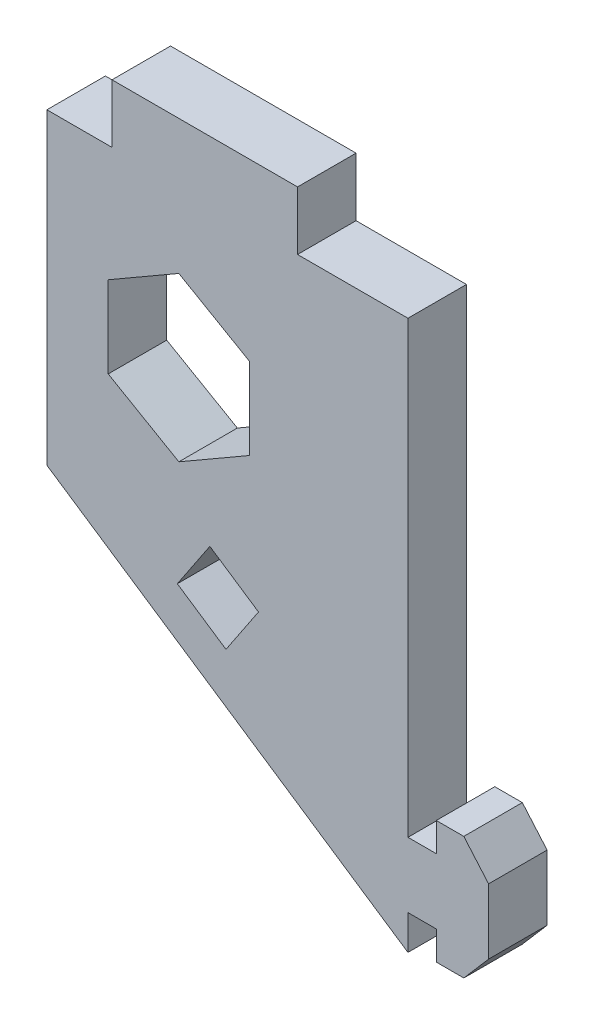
ISO-10303-21;
HEADER;
FILE_DESCRIPTION(('STEP AP214'),'2;1');
FILE_NAME('part.step','',(''),(''),'','','');
FILE_SCHEMA(('AUTOMOTIVE_DESIGN { 1 0 10303 214 1 1 1 1 }'));
ENDSEC;
DATA;
#1=APPLICATION_CONTEXT('core data for automotive mechanical design processes');
#2=APPLICATION_PROTOCOL_DEFINITION('international standard','automotive_design',2000,#1);
#3=PRODUCT_CONTEXT('',#1,'mechanical');
#4=PRODUCT('Part','Part','',(#3));
#5=PRODUCT_RELATED_PRODUCT_CATEGORY('part','',(#4));
#6=PRODUCT_DEFINITION_FORMATION('','',#4);
#7=PRODUCT_DEFINITION_CONTEXT('part definition',#1,'design');
#8=PRODUCT_DEFINITION('design','',#6,#7);
#9=PRODUCT_DEFINITION_SHAPE('','',#8);
#10=(LENGTH_UNIT() NAMED_UNIT(*) SI_UNIT(.MILLI.,.METRE.));
#11=(NAMED_UNIT(*) PLANE_ANGLE_UNIT() SI_UNIT($,.RADIAN.));
#12=(NAMED_UNIT(*) SI_UNIT($,.STERADIAN.) SOLID_ANGLE_UNIT());
#13=UNCERTAINTY_MEASURE_WITH_UNIT(LENGTH_MEASURE(1.E-05),#10,'distance_accuracy_value','');
#14=(GEOMETRIC_REPRESENTATION_CONTEXT(3) GLOBAL_UNCERTAINTY_ASSIGNED_CONTEXT((#13)) GLOBAL_UNIT_ASSIGNED_CONTEXT((#10,
#11,#12)) REPRESENTATION_CONTEXT('',''));
#15=CARTESIAN_POINT('',(0.,0.,0.));
#16=DIRECTION('',(0.,0.,1.));
#17=DIRECTION('',(1.,0.,0.));
#18=AXIS2_PLACEMENT_3D('',#15,#16,#17);
#19=CARTESIAN_POINT('',(-817.146115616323,0.,5.3848));
#20=DIRECTION('',(1.,0.,0.));
#21=DIRECTION('',(0.,0.,-1.));
#22=AXIS2_PLACEMENT_3D('',#19,#20,#21);
#23=PLANE('',#22);
#24=DIRECTION('',(0.,-1.,0.));
#25=VECTOR('',#24,1.);
#26=CARTESIAN_POINT('',(-817.146115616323,0.,0.));
#27=LINE('',#26,#25);
#28=CARTESIAN_POINT('',(-817.146115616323,356.815132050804,0.));
#29=VERTEX_POINT('',#28);
#30=CARTESIAN_POINT('',(-817.146115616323,349.309578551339,0.));
#31=VERTEX_POINT('',#30);
#32=EDGE_CURVE('E377',#29,#31,#27,.T.);
#33=ORIENTED_EDGE('',*,*,#32,.F.);
#34=DIRECTION('',(0.,0.,-1.));
#35=VECTOR('',#34,1.);
#36=CARTESIAN_POINT('',(-817.146115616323,356.815132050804,5.3848));
#37=LINE('',#36,#35);
#38=CARTESIAN_POINT('',(-817.146115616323,356.815132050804,5.3848));
#39=VERTEX_POINT('',#38);
#40=EDGE_CURVE('E12',#39,#29,#37,.T.);
#41=ORIENTED_EDGE('',*,*,#40,.F.);
#42=DIRECTION('',(0.,-1.,0.));
#43=VECTOR('',#42,1.);
#44=CARTESIAN_POINT('',(-817.146115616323,0.,5.3848));
#45=LINE('',#44,#43);
#46=CARTESIAN_POINT('',(-817.146115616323,349.309578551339,5.3848));
#47=VERTEX_POINT('',#46);
#48=EDGE_CURVE('E325',#39,#47,#45,.T.);
#49=ORIENTED_EDGE('',*,*,#48,.T.);
#50=DIRECTION('',(0.,0.,-1.));
#51=VECTOR('',#50,1.);
#52=CARTESIAN_POINT('',(-817.146115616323,349.309578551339,5.3848));
#53=LINE('',#52,#51);
#54=EDGE_CURVE('E394',#47,#31,#53,.T.);
#55=ORIENTED_EDGE('',*,*,#54,.T.);
#56=EDGE_LOOP('',(#33,#41,#49,#55));
#57=FACE_BOUND('',#56,.T.);
#58=ADVANCED_FACE('F38',(#57),#23,.T.);
#59=CARTESIAN_POINT('',(-358.792013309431,621.445996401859,5.3848));
#60=DIRECTION('',(0.500000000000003,-0.866025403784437,0.));
#61=DIRECTION('',(0.866025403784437,0.500000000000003,0.));
#62=AXIS2_PLACEMENT_3D('',#59,#60,#61);
#63=PLANE('',#62);
#64=DIRECTION('',(-0.866025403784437,-0.500000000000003,0.));
#65=VECTOR('',#64,1.);
#66=CARTESIAN_POINT('',(-358.792013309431,621.445996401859,0.));
#67=LINE('',#66,#65);
#68=CARTESIAN_POINT('',(-810.646115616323,360.567908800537,0.));
#69=VERTEX_POINT('',#68);
#70=EDGE_CURVE('E380',#69,#29,#67,.T.);
#71=ORIENTED_EDGE('',*,*,#70,.F.);
#72=DIRECTION('',(0.,0.,-1.));
#73=VECTOR('',#72,1.);
#74=CARTESIAN_POINT('',(-810.646115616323,360.567908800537,5.3848));
#75=LINE('',#74,#73);
#76=CARTESIAN_POINT('',(-810.646115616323,360.567908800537,5.3848));
#77=VERTEX_POINT('',#76);
#78=EDGE_CURVE('E47',#77,#69,#75,.T.);
#79=ORIENTED_EDGE('',*,*,#78,.F.);
#80=DIRECTION('',(-0.866025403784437,-0.500000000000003,0.));
#81=VECTOR('',#80,1.);
#82=CARTESIAN_POINT('',(-358.792013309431,621.445996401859,5.3848));
#83=LINE('',#82,#81);
#84=EDGE_CURVE('E328',#77,#39,#83,.T.);
#85=ORIENTED_EDGE('',*,*,#84,.T.);
#86=ORIENTED_EDGE('',*,*,#40,.T.);
#87=EDGE_LOOP('',(#71,#79,#85,#86));
#88=FACE_BOUND('',#87,.T.);
#89=ADVANCED_FACE('F525',(#88),#63,.T.);
#90=CARTESIAN_POINT('',(-46.5310444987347,-80.5941332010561,5.3848));
#91=DIRECTION('',(0.500000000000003,0.866025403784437,0.));
#92=DIRECTION('',(-0.866025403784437,0.500000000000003,0.));
#93=AXIS2_PLACEMENT_3D('',#90,#91,#92);
#94=PLANE('',#93);
#95=DIRECTION('',(0.866025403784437,-0.500000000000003,0.));
#96=VECTOR('',#95,1.);
#97=CARTESIAN_POINT('',(-46.5310444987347,-80.5941332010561,0.));
#98=LINE('',#97,#96);
#99=CARTESIAN_POINT('',(-804.146115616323,356.815132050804,0.));
#100=VERTEX_POINT('',#99);
#101=EDGE_CURVE('E383',#69,#100,#98,.T.);
#102=ORIENTED_EDGE('',*,*,#101,.T.);
#103=DIRECTION('',(0.,0.,-1.));
#104=VECTOR('',#103,1.);
#105=CARTESIAN_POINT('',(-804.146115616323,356.815132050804,5.3848));
#106=LINE('',#105,#104);
#107=CARTESIAN_POINT('',(-804.146115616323,356.815132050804,5.3848));
#108=VERTEX_POINT('',#107);
#109=EDGE_CURVE('E402',#108,#100,#106,.T.);
#110=ORIENTED_EDGE('',*,*,#109,.F.);
#111=DIRECTION('',(0.866025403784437,-0.500000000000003,0.));
#112=VECTOR('',#111,1.);
#113=CARTESIAN_POINT('',(-46.5310444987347,-80.5941332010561,5.3848));
#114=LINE('',#113,#112);
#115=EDGE_CURVE('E331',#77,#108,#114,.T.);
#116=ORIENTED_EDGE('',*,*,#115,.F.);
#117=ORIENTED_EDGE('',*,*,#78,.T.);
#118=EDGE_LOOP('',(#102,#110,#116,#117));
#119=FACE_BOUND('',#118,.T.);
#120=ADVANCED_FACE('F531',(#119),#94,.F.);
#121=CARTESIAN_POINT('',(-804.146115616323,0.,5.3848));
#122=DIRECTION('',(1.,0.,0.));
#123=DIRECTION('',(0.,0.,-1.));
#124=AXIS2_PLACEMENT_3D('',#121,#122,#123);
#125=PLANE('',#124);
#126=DIRECTION('',(0.,-1.,0.));
#127=VECTOR('',#126,1.);
#128=CARTESIAN_POINT('',(-804.146115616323,0.,0.));
#129=LINE('',#128,#127);
#130=CARTESIAN_POINT('',(-804.146115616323,349.309578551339,0.));
#131=VERTEX_POINT('',#130);
#132=EDGE_CURVE('E386',#100,#131,#129,.T.);
#133=ORIENTED_EDGE('',*,*,#132,.T.);
#134=DIRECTION('',(0.,0.,-1.));
#135=VECTOR('',#134,1.);
#136=CARTESIAN_POINT('',(-804.146115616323,349.309578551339,5.3848));
#137=LINE('',#136,#135);
#138=CARTESIAN_POINT('',(-804.146115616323,349.309578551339,5.3848));
#139=VERTEX_POINT('',#138);
#140=EDGE_CURVE('E399',#139,#131,#137,.T.);
#141=ORIENTED_EDGE('',*,*,#140,.F.);
#142=DIRECTION('',(0.,-1.,0.));
#143=VECTOR('',#142,1.);
#144=CARTESIAN_POINT('',(-804.146115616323,0.,5.3848));
#145=LINE('',#144,#143);
#146=EDGE_CURVE('E334',#108,#139,#145,.T.);
#147=ORIENTED_EDGE('',*,*,#146,.F.);
#148=ORIENTED_EDGE('',*,*,#109,.T.);
#149=EDGE_LOOP('',(#133,#141,#147,#148));
#150=FACE_BOUND('',#149,.T.);
#151=ADVANCED_FACE('F747',(#150),#125,.F.);
#152=CARTESIAN_POINT('',(-352.292013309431,610.187666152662,5.3848));
#153=DIRECTION('',(0.500000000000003,-0.866025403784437,0.));
#154=DIRECTION('',(0.866025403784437,0.500000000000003,0.));
#155=AXIS2_PLACEMENT_3D('',#152,#153,#154);
#156=PLANE('',#155);
#157=DIRECTION('',(-0.866025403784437,-0.500000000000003,0.));
#158=VECTOR('',#157,1.);
#159=CARTESIAN_POINT('',(-352.292013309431,610.187666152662,0.));
#160=LINE('',#159,#158);
#161=CARTESIAN_POINT('',(-810.646115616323,345.556801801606,0.));
#162=VERTEX_POINT('',#161);
#163=EDGE_CURVE('E389',#131,#162,#160,.T.);
#164=ORIENTED_EDGE('',*,*,#163,.T.);
#165=DIRECTION('',(0.,0.,-1.));
#166=VECTOR('',#165,1.);
#167=CARTESIAN_POINT('',(-810.646115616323,345.556801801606,5.3848));
#168=LINE('',#167,#166);
#169=CARTESIAN_POINT('',(-810.646115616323,345.556801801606,5.3848));
#170=VERTEX_POINT('',#169);
#171=EDGE_CURVE('E396',#170,#162,#168,.T.);
#172=ORIENTED_EDGE('',*,*,#171,.F.);
#173=DIRECTION('',(-0.866025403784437,-0.500000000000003,0.));
#174=VECTOR('',#173,1.);
#175=CARTESIAN_POINT('',(-352.292013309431,610.187666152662,5.3848));
#176=LINE('',#175,#174);
#177=EDGE_CURVE('E337',#139,#170,#176,.T.);
#178=ORIENTED_EDGE('',*,*,#177,.F.);
#179=ORIENTED_EDGE('',*,*,#140,.T.);
#180=EDGE_LOOP('',(#164,#172,#178,#179));
#181=FACE_BOUND('',#180,.T.);
#182=ADVANCED_FACE('F740',(#181),#156,.F.);
#183=CARTESIAN_POINT('',(-789.564115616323,0.,5.3848));
#184=DIRECTION('',(1.,0.,0.));
#185=DIRECTION('',(0.,0.,-1.));
#186=AXIS2_PLACEMENT_3D('',#183,#184,#185);
#187=PLANE('',#186);
#188=DIRECTION('',(0.,-1.,0.));
#189=VECTOR('',#188,1.);
#190=CARTESIAN_POINT('',(-789.564115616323,0.,0.));
#191=LINE('',#190,#189);
#192=CARTESIAN_POINT('',(-789.564115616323,320.175836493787,0.));
#193=VERTEX_POINT('',#192);
#194=CARTESIAN_POINT('',(-789.564115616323,317.000836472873,0.));
#195=VERTEX_POINT('',#194);
#196=EDGE_CURVE('E290',#193,#195,#191,.T.);
#197=ORIENTED_EDGE('',*,*,#196,.F.);
#198=DIRECTION('',(0.,0.,-1.));
#199=VECTOR('',#198,1.);
#200=CARTESIAN_POINT('',(-789.564115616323,320.175836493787,5.3848));
#201=LINE('',#200,#199);
#202=CARTESIAN_POINT('',(-789.564115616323,320.175836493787,5.3848));
#203=VERTEX_POINT('',#202);
#204=EDGE_CURVE('E42',#203,#193,#201,.T.);
#205=ORIENTED_EDGE('',*,*,#204,.F.);
#206=DIRECTION('',(0.,-1.,0.));
#207=VECTOR('',#206,1.);
#208=CARTESIAN_POINT('',(-789.564115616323,0.,5.3848));
#209=LINE('',#208,#207);
#210=CARTESIAN_POINT('',(-789.564115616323,317.000836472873,5.3848));
#211=VERTEX_POINT('',#210);
#212=EDGE_CURVE('E291',#203,#211,#209,.T.);
#213=ORIENTED_EDGE('',*,*,#212,.T.);
#214=DIRECTION('',(0.,0.,-1.));
#215=VECTOR('',#214,1.);
#216=CARTESIAN_POINT('',(-789.564115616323,317.000836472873,5.3848));
#217=LINE('',#216,#215);
#218=EDGE_CURVE('E342',#211,#195,#217,.T.);
#219=ORIENTED_EDGE('',*,*,#218,.T.);
#220=EDGE_LOOP('',(#197,#205,#213,#219));
#221=FACE_BOUND('',#220,.T.);
#222=ADVANCED_FACE('F40',(#221),#187,.T.);
#223=CARTESIAN_POINT('',(0.,320.175836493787,5.3848));
#224=DIRECTION('',(0.,1.,0.));
#225=DIRECTION('',(0.,0.,1.));
#226=AXIS2_PLACEMENT_3D('',#223,#224,#225);
#227=PLANE('',#226);
#228=DIRECTION('',(1.,0.,0.));
#229=VECTOR('',#228,1.);
#230=CARTESIAN_POINT('',(0.,320.175836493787,0.));
#231=LINE('',#230,#229);
#232=CARTESIAN_POINT('',(-786.957440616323,320.175836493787,0.));
#233=VERTEX_POINT('',#232);
#234=EDGE_CURVE('E345',#193,#233,#231,.T.);
#235=ORIENTED_EDGE('',*,*,#234,.T.);
#236=DIRECTION('',(0.,0.,-1.));
#237=VECTOR('',#236,1.);
#238=CARTESIAN_POINT('',(-786.957440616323,320.175836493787,5.3848));
#239=LINE('',#238,#237);
#240=CARTESIAN_POINT('',(-786.957440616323,320.175836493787,5.3848));
#241=VERTEX_POINT('',#240);
#242=EDGE_CURVE('E429',#241,#233,#239,.T.);
#243=ORIENTED_EDGE('',*,*,#242,.F.);
#244=DIRECTION('',(1.,0.,0.));
#245=VECTOR('',#244,1.);
#246=CARTESIAN_POINT('',(0.,320.175836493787,5.3848));
#247=LINE('',#246,#245);
#248=EDGE_CURVE('E294',#203,#241,#247,.T.);
#249=ORIENTED_EDGE('',*,*,#248,.F.);
#250=ORIENTED_EDGE('',*,*,#204,.T.);
#251=EDGE_LOOP('',(#235,#243,#249,#250));
#252=FACE_BOUND('',#251,.T.);
#253=ADVANCED_FACE('F438',(#252),#227,.F.);
#254=CARTESIAN_POINT('',(-786.957440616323,0.,5.3848));
#255=DIRECTION('',(1.,0.,0.));
#256=DIRECTION('',(0.,0.,-1.));
#257=AXIS2_PLACEMENT_3D('',#254,#255,#256);
#258=PLANE('',#257);
#259=DIRECTION('',(0.,-1.,0.));
#260=VECTOR('',#259,1.);
#261=CARTESIAN_POINT('',(-786.957440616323,0.,0.));
#262=LINE('',#261,#260);
#263=CARTESIAN_POINT('',(-786.957440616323,317.531556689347,0.));
#264=VERTEX_POINT('',#263);
#265=EDGE_CURVE('E347',#233,#264,#262,.T.);
#266=ORIENTED_EDGE('',*,*,#265,.T.);
#267=DIRECTION('',(0.,0.,-1.));
#268=VECTOR('',#267,1.);
#269=CARTESIAN_POINT('',(-786.957440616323,317.531556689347,5.3848));
#270=LINE('',#269,#268);
#271=CARTESIAN_POINT('',(-786.957440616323,317.531556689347,5.3848));
#272=VERTEX_POINT('',#271);
#273=EDGE_CURVE('E427',#272,#264,#270,.T.);
#274=ORIENTED_EDGE('',*,*,#273,.F.);
#275=DIRECTION('',(0.,-1.,0.));
#276=VECTOR('',#275,1.);
#277=CARTESIAN_POINT('',(-786.957440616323,0.,5.3848));
#278=LINE('',#277,#276);
#279=EDGE_CURVE('E297',#241,#272,#278,.T.);
#280=ORIENTED_EDGE('',*,*,#279,.F.);
#281=ORIENTED_EDGE('',*,*,#242,.T.);
#282=EDGE_LOOP('',(#266,#274,#280,#281));
#283=FACE_BOUND('',#282,.T.);
#284=ADVANCED_FACE('F516',(#283),#258,.F.);
#285=CARTESIAN_POINT('',(0.,317.531556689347,5.3848));
#286=DIRECTION('',(0.,1.,0.));
#287=DIRECTION('',(0.,0.,1.));
#288=AXIS2_PLACEMENT_3D('',#285,#286,#287);
#289=PLANE('',#288);
#290=DIRECTION('',(1.,0.,0.));
#291=VECTOR('',#290,1.);
#292=CARTESIAN_POINT('',(0.,317.531556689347,0.));
#293=LINE('',#292,#291);
#294=CARTESIAN_POINT('',(-784.424789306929,317.531556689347,0.));
#295=VERTEX_POINT('',#294);
#296=EDGE_CURVE('E349',#264,#295,#293,.T.);
#297=ORIENTED_EDGE('',*,*,#296,.T.);
#298=DIRECTION('',(0.,0.,-1.));
#299=VECTOR('',#298,1.);
#300=CARTESIAN_POINT('',(-784.424789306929,317.531556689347,5.3848));
#301=LINE('',#300,#299);
#302=CARTESIAN_POINT('',(-784.424789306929,317.531556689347,5.3848));
#303=VERTEX_POINT('',#302);
#304=EDGE_CURVE('E424',#303,#295,#301,.T.);
#305=ORIENTED_EDGE('',*,*,#304,.F.);
#306=DIRECTION('',(1.,0.,0.));
#307=VECTOR('',#306,1.);
#308=CARTESIAN_POINT('',(0.,317.531556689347,5.3848));
#309=LINE('',#308,#307);
#310=EDGE_CURVE('E299',#272,#303,#309,.T.);
#311=ORIENTED_EDGE('',*,*,#310,.F.);
#312=ORIENTED_EDGE('',*,*,#273,.T.);
#313=EDGE_LOOP('',(#297,#305,#311,#312));
#314=FACE_BOUND('',#313,.T.);
#315=ADVANCED_FACE('F514',(#314),#289,.F.);
#316=CARTESIAN_POINT('',(-606.941806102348,523.359270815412,5.3848));
#317=DIRECTION('',(-0.757327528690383,0.65303523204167,0.));
#318=DIRECTION('',(-0.65303523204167,-0.757327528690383,0.));
#319=AXIS2_PLACEMENT_3D('',#316,#317,#318);
#320=PLANE('',#319);
#321=DIRECTION('',(0.65303523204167,0.757327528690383,0.));
#322=VECTOR('',#321,1.);
#323=CARTESIAN_POINT('',(-606.941806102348,523.359270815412,0.));
#324=LINE('',#323,#322);
#325=CARTESIAN_POINT('',(-782.144655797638,320.175836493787,0.));
#326=VERTEX_POINT('',#325);
#327=EDGE_CURVE('E351',#295,#326,#324,.T.);
#328=ORIENTED_EDGE('',*,*,#327,.T.);
#329=DIRECTION('',(0.,0.,-1.));
#330=VECTOR('',#329,1.);
#331=CARTESIAN_POINT('',(-782.144655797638,320.175836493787,5.3848));
#332=LINE('',#331,#330);
#333=CARTESIAN_POINT('',(-782.144655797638,320.175836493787,5.3848));
#334=VERTEX_POINT('',#333);
#335=EDGE_CURVE('E421',#334,#326,#332,.T.);
#336=ORIENTED_EDGE('',*,*,#335,.F.);
#337=DIRECTION('',(0.65303523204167,0.757327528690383,0.));
#338=VECTOR('',#337,1.);
#339=CARTESIAN_POINT('',(-606.941806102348,523.359270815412,5.3848));
#340=LINE('',#339,#338);
#341=EDGE_CURVE('E301',#303,#334,#340,.T.);
#342=ORIENTED_EDGE('',*,*,#341,.F.);
#343=ORIENTED_EDGE('',*,*,#304,.T.);
#344=EDGE_LOOP('',(#328,#336,#342,#343));
#345=FACE_BOUND('',#344,.T.);
#346=ADVANCED_FACE('F510',(#345),#320,.F.);
#347=CARTESIAN_POINT('',(-782.144655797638,0.,5.3848));
#348=DIRECTION('',(-1.,0.,0.));
#349=DIRECTION('',(0.,0.,1.));
#350=AXIS2_PLACEMENT_3D('',#347,#348,#349);
#351=PLANE('',#350);
#352=DIRECTION('',(0.,1.,0.));
#353=VECTOR('',#352,1.);
#354=CARTESIAN_POINT('',(-782.144655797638,0.,0.));
#355=LINE('',#354,#353);
#356=CARTESIAN_POINT('',(-782.144655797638,326.173777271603,0.));
#357=VERTEX_POINT('',#356);
#358=EDGE_CURVE('E353',#326,#357,#355,.T.);
#359=ORIENTED_EDGE('',*,*,#358,.T.);
#360=DIRECTION('',(0.,0.,-1.));
#361=VECTOR('',#360,1.);
#362=CARTESIAN_POINT('',(-782.144655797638,326.173777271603,5.3848));
#363=LINE('',#362,#361);
#364=CARTESIAN_POINT('',(-782.144655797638,326.173777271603,5.3848));
#365=VERTEX_POINT('',#364);
#366=EDGE_CURVE('E419',#365,#357,#363,.T.);
#367=ORIENTED_EDGE('',*,*,#366,.F.);
#368=DIRECTION('',(0.,1.,0.));
#369=VECTOR('',#368,1.);
#370=CARTESIAN_POINT('',(-782.144655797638,0.,5.3848));
#371=LINE('',#370,#369);
#372=EDGE_CURVE('E303',#334,#365,#371,.T.);
#373=ORIENTED_EDGE('',*,*,#372,.F.);
#374=ORIENTED_EDGE('',*,*,#335,.T.);
#375=EDGE_LOOP('',(#359,#367,#373,#374));
#376=FACE_BOUND('',#375,.T.);
#377=ADVANCED_FACE('F505',(#376),#351,.F.);
#378=CARTESIAN_POINT('',(-287.282133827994,-247.720237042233,5.3848));
#379=DIRECTION('',(0.757327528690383,0.65303523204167,0.));
#380=DIRECTION('',(-0.65303523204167,0.757327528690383,0.));
#381=AXIS2_PLACEMENT_3D('',#378,#379,#380);
#382=PLANE('',#381);
#383=DIRECTION('',(0.65303523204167,-0.757327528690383,0.));
#384=VECTOR('',#383,1.);
#385=CARTESIAN_POINT('',(-287.282133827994,-247.720237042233,0.));
#386=LINE('',#385,#384);
#387=CARTESIAN_POINT('',(-784.424789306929,328.818057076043,0.));
#388=VERTEX_POINT('',#387);
#389=EDGE_CURVE('E356',#388,#357,#386,.T.);
#390=ORIENTED_EDGE('',*,*,#389,.F.);
#391=DIRECTION('',(0.,0.,-1.));
#392=VECTOR('',#391,1.);
#393=CARTESIAN_POINT('',(-784.424789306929,328.818057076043,5.3848));
#394=LINE('',#393,#392);
#395=CARTESIAN_POINT('',(-784.424789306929,328.818057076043,5.3848));
#396=VERTEX_POINT('',#395);
#397=EDGE_CURVE('E417',#396,#388,#394,.T.);
#398=ORIENTED_EDGE('',*,*,#397,.F.);
#399=DIRECTION('',(0.65303523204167,-0.757327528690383,0.));
#400=VECTOR('',#399,1.);
#401=CARTESIAN_POINT('',(-287.282133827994,-247.720237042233,5.3848));
#402=LINE('',#401,#400);
#403=EDGE_CURVE('E305',#396,#365,#402,.T.);
#404=ORIENTED_EDGE('',*,*,#403,.T.);
#405=ORIENTED_EDGE('',*,*,#366,.T.);
#406=EDGE_LOOP('',(#390,#398,#404,#405));
#407=FACE_BOUND('',#406,.T.);
#408=ADVANCED_FACE('F500',(#407),#382,.T.);
#409=CARTESIAN_POINT('',(0.,328.818057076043,5.3848));
#410=DIRECTION('',(0.,1.,0.));
#411=DIRECTION('',(0.,0.,1.));
#412=AXIS2_PLACEMENT_3D('',#409,#410,#411);
#413=PLANE('',#412);
#414=DIRECTION('',(1.,0.,0.));
#415=VECTOR('',#414,1.);
#416=CARTESIAN_POINT('',(0.,328.818057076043,0.));
#417=LINE('',#416,#415);
#418=CARTESIAN_POINT('',(-786.957440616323,328.818057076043,0.));
#419=VERTEX_POINT('',#418);
#420=EDGE_CURVE('E359',#419,#388,#417,.T.);
#421=ORIENTED_EDGE('',*,*,#420,.F.);
#422=DIRECTION('',(0.,0.,-1.));
#423=VECTOR('',#422,1.);
#424=CARTESIAN_POINT('',(-786.957440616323,328.818057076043,5.3848));
#425=LINE('',#424,#423);
#426=CARTESIAN_POINT('',(-786.957440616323,328.818057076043,5.3848));
#427=VERTEX_POINT('',#426);
#428=EDGE_CURVE('E415',#427,#419,#425,.T.);
#429=ORIENTED_EDGE('',*,*,#428,.F.);
#430=DIRECTION('',(1.,0.,0.));
#431=VECTOR('',#430,1.);
#432=CARTESIAN_POINT('',(0.,328.818057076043,5.3848));
#433=LINE('',#432,#431);
#434=EDGE_CURVE('E308',#427,#396,#433,.T.);
#435=ORIENTED_EDGE('',*,*,#434,.T.);
#436=ORIENTED_EDGE('',*,*,#397,.T.);
#437=EDGE_LOOP('',(#421,#429,#435,#436));
#438=FACE_BOUND('',#437,.T.);
#439=ADVANCED_FACE('F496',(#438),#413,.T.);
#440=CARTESIAN_POINT('',(-786.957440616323,0.,5.3848));
#441=DIRECTION('',(-1.,0.,0.));
#442=DIRECTION('',(0.,0.,1.));
#443=AXIS2_PLACEMENT_3D('',#440,#441,#442);
#444=PLANE('',#443);
#445=DIRECTION('',(0.,1.,0.));
#446=VECTOR('',#445,1.);
#447=CARTESIAN_POINT('',(-786.957440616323,0.,0.));
#448=LINE('',#447,#446);
#449=CARTESIAN_POINT('',(-786.957440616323,326.173777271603,0.));
#450=VERTEX_POINT('',#449);
#451=EDGE_CURVE('E362',#450,#419,#448,.T.);
#452=ORIENTED_EDGE('',*,*,#451,.F.);
#453=DIRECTION('',(0.,0.,-1.));
#454=VECTOR('',#453,1.);
#455=CARTESIAN_POINT('',(-786.957440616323,326.173777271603,5.3848));
#456=LINE('',#455,#454);
#457=CARTESIAN_POINT('',(-786.957440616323,326.173777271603,5.3848));
#458=VERTEX_POINT('',#457);
#459=EDGE_CURVE('E413',#458,#450,#456,.T.);
#460=ORIENTED_EDGE('',*,*,#459,.F.);
#461=DIRECTION('',(0.,1.,0.));
#462=VECTOR('',#461,1.);
#463=CARTESIAN_POINT('',(-786.957440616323,0.,5.3848));
#464=LINE('',#463,#462);
#465=EDGE_CURVE('E311',#458,#427,#464,.T.);
#466=ORIENTED_EDGE('',*,*,#465,.T.);
#467=ORIENTED_EDGE('',*,*,#428,.T.);
#468=EDGE_LOOP('',(#452,#460,#466,#467));
#469=FACE_BOUND('',#468,.T.);
#470=ADVANCED_FACE('F492',(#469),#444,.T.);
#471=CARTESIAN_POINT('',(0.,326.173777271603,5.3848));
#472=DIRECTION('',(0.,1.,0.));
#473=DIRECTION('',(0.,0.,1.));
#474=AXIS2_PLACEMENT_3D('',#471,#472,#473);
#475=PLANE('',#474);
#476=DIRECTION('',(1.,0.,0.));
#477=VECTOR('',#476,1.);
#478=CARTESIAN_POINT('',(0.,326.173777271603,0.));
#479=LINE('',#478,#477);
#480=CARTESIAN_POINT('',(-789.564115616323,326.173777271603,0.));
#481=VERTEX_POINT('',#480);
#482=EDGE_CURVE('E365',#481,#450,#479,.T.);
#483=ORIENTED_EDGE('',*,*,#482,.F.);
#484=DIRECTION('',(0.,0.,-1.));
#485=VECTOR('',#484,1.);
#486=CARTESIAN_POINT('',(-789.564115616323,326.173777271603,5.3848));
#487=LINE('',#486,#485);
#488=CARTESIAN_POINT('',(-789.564115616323,326.173777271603,5.3848));
#489=VERTEX_POINT('',#488);
#490=EDGE_CURVE('E410',#489,#481,#487,.T.);
#491=ORIENTED_EDGE('',*,*,#490,.F.);
#492=DIRECTION('',(1.,0.,0.));
#493=VECTOR('',#492,1.);
#494=CARTESIAN_POINT('',(0.,326.173777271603,5.3848));
#495=LINE('',#494,#493);
#496=EDGE_CURVE('E314',#489,#458,#495,.T.);
#497=ORIENTED_EDGE('',*,*,#496,.T.);
#498=ORIENTED_EDGE('',*,*,#459,.T.);
#499=EDGE_LOOP('',(#483,#491,#497,#498));
#500=FACE_BOUND('',#499,.T.);
#501=ADVANCED_FACE('F488',(#500),#475,.T.);
#502=CARTESIAN_POINT('',(-789.564115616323,0.,5.3848));
#503=DIRECTION('',(1.,0.,0.));
#504=DIRECTION('',(0.,0.,-1.));
#505=AXIS2_PLACEMENT_3D('',#502,#503,#504);
#506=PLANE('',#505);
#507=DIRECTION('',(0.,0.,1.));
#508=VECTOR('',#507,1.);
#509=CARTESIAN_POINT('',(-789.564115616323,367.540355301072,-11.4987682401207));
#510=LINE('',#509,#508);
#511=CARTESIAN_POINT('',(-789.564115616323,367.540355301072,0.));
#512=VERTEX_POINT('',#511);
#513=CARTESIAN_POINT('',(-789.564115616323,367.540355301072,5.3848));
#514=VERTEX_POINT('',#513);
#515=EDGE_CURVE('E285',#512,#514,#510,.T.);
#516=ORIENTED_EDGE('',*,*,#515,.T.);
#517=DIRECTION('',(0.,-1.,0.));
#518=VECTOR('',#517,1.);
#519=CARTESIAN_POINT('',(-789.564115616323,0.,5.3848));
#520=LINE('',#519,#518);
#521=EDGE_CURVE('E317',#514,#489,#520,.T.);
#522=ORIENTED_EDGE('',*,*,#521,.T.);
#523=ORIENTED_EDGE('',*,*,#490,.T.);
#524=DIRECTION('',(0.,-1.,0.));
#525=VECTOR('',#524,1.);
#526=CARTESIAN_POINT('',(-789.564115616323,0.,0.));
#527=LINE('',#526,#525);
#528=EDGE_CURVE('E368',#512,#481,#527,.T.);
#529=ORIENTED_EDGE('',*,*,#528,.F.);
#530=EDGE_LOOP('',(#516,#522,#523,#529));
#531=FACE_BOUND('',#530,.T.);
#532=ADVANCED_FACE('F482',(#531),#506,.T.);
#533=CARTESIAN_POINT('',(0.,372.925155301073,5.3848));
#534=DIRECTION('',(0.,1.,0.));
#535=DIRECTION('',(0.,0.,1.));
#536=AXIS2_PLACEMENT_3D('',#533,#534,#535);
#537=PLANE('',#536);
#538=DIRECTION('',(0.,0.,1.));
#539=VECTOR('',#538,1.);
#540=CARTESIAN_POINT('',(-816.797678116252,372.925155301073,-11.4987682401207));
#541=LINE('',#540,#539);
#542=CARTESIAN_POINT('',(-816.797678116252,372.925155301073,0.));
#543=VERTEX_POINT('',#542);
#544=CARTESIAN_POINT('',(-816.797678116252,372.925155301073,5.3848));
#545=VERTEX_POINT('',#544);
#546=EDGE_CURVE('E260',#543,#545,#541,.T.);
#547=ORIENTED_EDGE('',*,*,#546,.T.);
#548=DIRECTION('',(1.,0.,0.));
#549=VECTOR('',#548,1.);
#550=CARTESIAN_POINT('',(0.,372.925155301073,5.3848));
#551=LINE('',#550,#549);
#552=CARTESIAN_POINT('',(-799.724115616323,372.925155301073,5.3848));
#553=VERTEX_POINT('',#552);
#554=EDGE_CURVE('E319',#545,#553,#551,.T.);
#555=ORIENTED_EDGE('',*,*,#554,.T.);
#556=DIRECTION('',(0.,0.,1.));
#557=VECTOR('',#556,1.);
#558=CARTESIAN_POINT('',(-799.724115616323,372.925155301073,-11.4987682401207));
#559=LINE('',#558,#557);
#560=CARTESIAN_POINT('',(-799.724115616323,372.925155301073,0.));
#561=VERTEX_POINT('',#560);
#562=EDGE_CURVE('E277',#561,#553,#559,.T.);
#563=ORIENTED_EDGE('',*,*,#562,.F.);
#564=DIRECTION('',(1.,0.,0.));
#565=VECTOR('',#564,1.);
#566=CARTESIAN_POINT('',(0.,372.925155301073,0.));
#567=LINE('',#566,#565);
#568=EDGE_CURVE('E370',#543,#561,#567,.T.);
#569=ORIENTED_EDGE('',*,*,#568,.F.);
#570=EDGE_LOOP('',(#547,#555,#563,#569));
#571=FACE_BOUND('',#570,.T.);
#572=ADVANCED_FACE('F470',(#571),#537,.T.);
#573=CARTESIAN_POINT('',(-822.787925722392,0.,5.3848));
#574=DIRECTION('',(1.,0.,0.));
#575=DIRECTION('',(0.,0.,-1.));
#576=AXIS2_PLACEMENT_3D('',#573,#574,#575);
#577=PLANE('',#576);
#578=DIRECTION('',(0.,-1.,0.));
#579=VECTOR('',#578,1.);
#580=CARTESIAN_POINT('',(-822.787925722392,0.,5.3848));
#581=LINE('',#580,#579);
#582=CARTESIAN_POINT('',(-822.787925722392,367.540355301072,5.3848));
#583=VERTEX_POINT('',#582);
#584=CARTESIAN_POINT('',(-822.787925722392,339.210458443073,5.3848));
#585=VERTEX_POINT('',#584);
#586=EDGE_CURVE('E321',#583,#585,#581,.T.);
#587=ORIENTED_EDGE('',*,*,#586,.F.);
#588=DIRECTION('',(0.,0.,1.));
#589=VECTOR('',#588,1.);
#590=CARTESIAN_POINT('',(-822.787925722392,367.540355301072,-11.4987682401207));
#591=LINE('',#590,#589);
#592=CARTESIAN_POINT('',(-822.787925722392,367.540355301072,0.));
#593=VERTEX_POINT('',#592);
#594=EDGE_CURVE('E265',#593,#583,#591,.T.);
#595=ORIENTED_EDGE('',*,*,#594,.F.);
#596=DIRECTION('',(0.,-1.,0.));
#597=VECTOR('',#596,1.);
#598=CARTESIAN_POINT('',(-822.787925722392,0.,0.));
#599=LINE('',#598,#597);
#600=CARTESIAN_POINT('',(-822.787925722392,339.210458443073,0.));
#601=VERTEX_POINT('',#600);
#602=EDGE_CURVE('E372',#593,#601,#599,.T.);
#603=ORIENTED_EDGE('',*,*,#602,.T.);
#604=DIRECTION('',(0.,0.,-1.));
#605=VECTOR('',#604,1.);
#606=CARTESIAN_POINT('',(-822.787925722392,339.210458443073,5.3848));
#607=LINE('',#606,#605);
#608=EDGE_CURVE('E407',#585,#601,#607,.T.);
#609=ORIENTED_EDGE('',*,*,#608,.F.);
#610=EDGE_LOOP('',(#587,#595,#603,#609));
#611=FACE_BOUND('',#610,.T.);
#612=ADVANCED_FACE('F458',(#611),#577,.F.);
#613=CARTESIAN_POINT('',(-97.3990693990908,-145.701182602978,5.3848));
#614=DIRECTION('',(0.555746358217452,0.831351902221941,0.));
#615=DIRECTION('',(-0.831351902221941,0.555746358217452,0.));
#616=AXIS2_PLACEMENT_3D('',#613,#614,#615);
#617=PLANE('',#616);
#618=DIRECTION('',(0.831351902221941,-0.555746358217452,0.));
#619=VECTOR('',#618,1.);
#620=CARTESIAN_POINT('',(-97.3990693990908,-145.701182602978,0.));
#621=LINE('',#620,#619);
#622=EDGE_CURVE('E374',#601,#195,#621,.T.);
#623=ORIENTED_EDGE('',*,*,#622,.T.);
#624=ORIENTED_EDGE('',*,*,#218,.F.);
#625=DIRECTION('',(0.831351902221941,-0.555746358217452,0.));
#626=VECTOR('',#625,1.);
#627=CARTESIAN_POINT('',(-97.3990693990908,-145.701182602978,5.3848));
#628=LINE('',#627,#626);
#629=EDGE_CURVE('E323',#585,#211,#628,.T.);
#630=ORIENTED_EDGE('',*,*,#629,.F.);
#631=ORIENTED_EDGE('',*,*,#608,.T.);
#632=EDGE_LOOP('',(#623,#624,#630,#631));
#633=FACE_BOUND('',#632,.T.);
#634=ADVANCED_FACE('F451',(#633),#617,.F.);
#635=CARTESIAN_POINT('',(-53.0310444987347,-91.8524634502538,5.3848));
#636=DIRECTION('',(-0.500000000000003,-0.866025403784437,0.));
#637=DIRECTION('',(0.866025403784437,-0.500000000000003,0.));
#638=AXIS2_PLACEMENT_3D('',#635,#636,#637);
#639=PLANE('',#638);
#640=DIRECTION('',(-0.866025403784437,0.500000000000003,0.));
#641=VECTOR('',#640,1.);
#642=CARTESIAN_POINT('',(-53.0310444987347,-91.8524634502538,0.));
#643=LINE('',#642,#641);
#644=EDGE_CURVE('E295',#162,#31,#643,.T.);
#645=ORIENTED_EDGE('',*,*,#644,.T.);
#646=ORIENTED_EDGE('',*,*,#54,.F.);
#647=DIRECTION('',(-0.866025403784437,0.500000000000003,0.));
#648=VECTOR('',#647,1.);
#649=CARTESIAN_POINT('',(-53.0310444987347,-91.8524634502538,5.3848));
#650=LINE('',#649,#648);
#651=EDGE_CURVE('E340',#170,#47,#650,.T.);
#652=ORIENTED_EDGE('',*,*,#651,.F.);
#653=ORIENTED_EDGE('',*,*,#171,.T.);
#654=EDGE_LOOP('',(#645,#646,#652,#653));
#655=FACE_BOUND('',#654,.T.);
#656=ADVANCED_FACE('F539',(#655),#639,.F.);
#657=CARTESIAN_POINT('',(0.,0.,5.3848));
#658=DIRECTION('',(0.,0.,1.));
#659=DIRECTION('',(1.,0.,0.));
#660=AXIS2_PLACEMENT_3D('',#657,#658,#659);
#661=PLANE('',#660);
#662=DIRECTION('',(-0.555746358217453,-0.83135190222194,0.));
#663=VECTOR('',#662,1.);
#664=CARTESIAN_POINT('',(-810.785833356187,335.770135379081,5.3848));
#665=LINE('',#664,#663);
#666=CARTESIAN_POINT('',(-807.793250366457,340.246799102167,5.3848));
#667=VERTEX_POINT('',#666);
#668=CARTESIAN_POINT('',(-810.785833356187,335.770135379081,5.3848));
#669=VERTEX_POINT('',#668);
#670=EDGE_CURVE('E55',#667,#669,#665,.T.);
#671=ORIENTED_EDGE('',*,*,#670,.F.);
#672=DIRECTION('',(-0.831351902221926,0.555746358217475,0.));
#673=VECTOR('',#672,1.);
#674=CARTESIAN_POINT('',(-807.793250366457,340.246799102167,5.3848));
#675=LINE('',#674,#673);
#676=CARTESIAN_POINT('',(-803.316586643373,337.254216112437,5.3848));
#677=VERTEX_POINT('',#676);
#678=EDGE_CURVE('E243',#677,#667,#675,.T.);
#679=ORIENTED_EDGE('',*,*,#678,.F.);
#680=DIRECTION('',(0.555746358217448,0.831351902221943,0.));
#681=VECTOR('',#680,1.);
#682=CARTESIAN_POINT('',(-803.316586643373,337.254216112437,5.3848));
#683=LINE('',#682,#681);
#684=CARTESIAN_POINT('',(-806.309169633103,332.777552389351,5.3848));
#685=VERTEX_POINT('',#684);
#686=EDGE_CURVE('E227',#685,#677,#683,.T.);
#687=ORIENTED_EDGE('',*,*,#686,.F.);
#688=DIRECTION('',(0.831351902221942,-0.555746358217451,0.));
#689=VECTOR('',#688,1.);
#690=CARTESIAN_POINT('',(-806.309169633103,332.777552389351,5.3848));
#691=LINE('',#690,#689);
#692=EDGE_CURVE('E236',#669,#685,#691,.T.);
#693=ORIENTED_EDGE('',*,*,#692,.F.);
#694=EDGE_LOOP('',(#671,#679,#687,#693));
#695=FACE_BOUND('',#694,.T.);
#696=DIRECTION('',(0.,1.,0.));
#697=VECTOR('',#696,1.);
#698=CARTESIAN_POINT('',(-816.797678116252,367.540355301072,5.3848));
#699=LINE('',#698,#697);
#700=CARTESIAN_POINT('',(-816.797678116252,367.540355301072,5.3848));
#701=VERTEX_POINT('',#700);
#702=EDGE_CURVE('E263',#701,#545,#699,.T.);
#703=ORIENTED_EDGE('',*,*,#702,.F.);
#704=DIRECTION('',(1.,0.,0.));
#705=VECTOR('',#704,1.);
#706=CARTESIAN_POINT('',(-816.797678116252,367.540355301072,5.3848));
#707=LINE('',#706,#705);
#708=EDGE_CURVE('E254',#583,#701,#707,.T.);
#709=ORIENTED_EDGE('',*,*,#708,.F.);
#710=ORIENTED_EDGE('',*,*,#586,.T.);
#711=ORIENTED_EDGE('',*,*,#629,.T.);
#712=ORIENTED_EDGE('',*,*,#212,.F.);
#713=ORIENTED_EDGE('',*,*,#248,.T.);
#714=ORIENTED_EDGE('',*,*,#279,.T.);
#715=ORIENTED_EDGE('',*,*,#310,.T.);
#716=ORIENTED_EDGE('',*,*,#341,.T.);
#717=ORIENTED_EDGE('',*,*,#372,.T.);
#718=ORIENTED_EDGE('',*,*,#403,.F.);
#719=ORIENTED_EDGE('',*,*,#434,.F.);
#720=ORIENTED_EDGE('',*,*,#465,.F.);
#721=ORIENTED_EDGE('',*,*,#496,.F.);
#722=ORIENTED_EDGE('',*,*,#521,.F.);
#723=DIRECTION('',(1.,0.,0.));
#724=VECTOR('',#723,1.);
#725=CARTESIAN_POINT('',(-799.724115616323,367.540355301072,5.3848));
#726=LINE('',#725,#724);
#727=CARTESIAN_POINT('',(-799.724115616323,367.540355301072,5.3848));
#728=VERTEX_POINT('',#727);
#729=EDGE_CURVE('E280',#728,#514,#726,.T.);
#730=ORIENTED_EDGE('',*,*,#729,.F.);
#731=DIRECTION('',(0.,-1.,0.));
#732=VECTOR('',#731,1.);
#733=CARTESIAN_POINT('',(-799.724115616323,372.925155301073,5.3848));
#734=LINE('',#733,#732);
#735=EDGE_CURVE('E272',#553,#728,#734,.T.);
#736=ORIENTED_EDGE('',*,*,#735,.F.);
#737=ORIENTED_EDGE('',*,*,#554,.F.);
#738=EDGE_LOOP('',(#703,#709,#710,#711,#712,#713,#714,#715,#716,#717,#718,#719,#720,#721,#722,
#730,#736,#737));
#739=FACE_BOUND('',#738,.T.);
#740=ORIENTED_EDGE('',*,*,#48,.F.);
#741=ORIENTED_EDGE('',*,*,#84,.F.);
#742=ORIENTED_EDGE('',*,*,#115,.T.);
#743=ORIENTED_EDGE('',*,*,#146,.T.);
#744=ORIENTED_EDGE('',*,*,#177,.T.);
#745=ORIENTED_EDGE('',*,*,#651,.T.);
#746=EDGE_LOOP('',(#740,#741,#742,#743,#744,#745));
#747=FACE_BOUND('',#746,.T.);
#748=ADVANCED_FACE('F240',(#695,#739,#747),#661,.T.);
#749=CARTESIAN_POINT('',(0.,0.,0.));
#750=DIRECTION('',(0.,0.,1.));
#751=DIRECTION('',(1.,0.,0.));
#752=AXIS2_PLACEMENT_3D('',#749,#750,#751);
#753=PLANE('',#752);
#754=DIRECTION('',(0.831351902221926,-0.555746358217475,0.));
#755=VECTOR('',#754,1.);
#756=CARTESIAN_POINT('',(-807.793250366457,340.246799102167,0.));
#757=LINE('',#756,#755);
#758=CARTESIAN_POINT('',(-807.793250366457,340.246799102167,0.));
#759=VERTEX_POINT('',#758);
#760=CARTESIAN_POINT('',(-803.316586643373,337.254216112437,0.));
#761=VERTEX_POINT('',#760);
#762=EDGE_CURVE('E791',#759,#761,#757,.T.);
#763=ORIENTED_EDGE('',*,*,#762,.F.);
#764=DIRECTION('',(0.555746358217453,0.83135190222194,0.));
#765=VECTOR('',#764,1.);
#766=CARTESIAN_POINT('',(-810.785833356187,335.770135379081,0.));
#767=LINE('',#766,#765);
#768=CARTESIAN_POINT('',(-810.785833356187,335.770135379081,0.));
#769=VERTEX_POINT('',#768);
#770=EDGE_CURVE('E255',#769,#759,#767,.T.);
#771=ORIENTED_EDGE('',*,*,#770,.F.);
#772=DIRECTION('',(-0.831351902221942,0.555746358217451,0.));
#773=VECTOR('',#772,1.);
#774=CARTESIAN_POINT('',(-806.309169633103,332.777552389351,0.));
#775=LINE('',#774,#773);
#776=CARTESIAN_POINT('',(-806.309169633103,332.777552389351,0.));
#777=VERTEX_POINT('',#776);
#778=EDGE_CURVE('E252',#777,#769,#775,.T.);
#779=ORIENTED_EDGE('',*,*,#778,.F.);
#780=DIRECTION('',(-0.555746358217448,-0.831351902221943,0.));
#781=VECTOR('',#780,1.);
#782=CARTESIAN_POINT('',(-803.316586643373,337.254216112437,0.));
#783=LINE('',#782,#781);
#784=EDGE_CURVE('E230',#761,#777,#783,.T.);
#785=ORIENTED_EDGE('',*,*,#784,.F.);
#786=EDGE_LOOP('',(#763,#771,#779,#785));
#787=FACE_BOUND('',#786,.T.);
#788=DIRECTION('',(-1.,0.,0.));
#789=VECTOR('',#788,1.);
#790=CARTESIAN_POINT('',(-816.797678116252,367.540355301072,0.));
#791=LINE('',#790,#789);
#792=CARTESIAN_POINT('',(-816.797678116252,367.540355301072,0.));
#793=VERTEX_POINT('',#792);
#794=EDGE_CURVE('E259',#793,#593,#791,.T.);
#795=ORIENTED_EDGE('',*,*,#794,.F.);
#796=DIRECTION('',(0.,-1.,0.));
#797=VECTOR('',#796,1.);
#798=CARTESIAN_POINT('',(-816.797678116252,367.540355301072,0.));
#799=LINE('',#798,#797);
#800=EDGE_CURVE('E256',#543,#793,#799,.T.);
#801=ORIENTED_EDGE('',*,*,#800,.F.);
#802=ORIENTED_EDGE('',*,*,#568,.T.);
#803=DIRECTION('',(0.,1.,0.));
#804=VECTOR('',#803,1.);
#805=CARTESIAN_POINT('',(-799.724115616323,372.925155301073,0.));
#806=LINE('',#805,#804);
#807=CARTESIAN_POINT('',(-799.724115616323,367.540355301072,0.));
#808=VERTEX_POINT('',#807);
#809=EDGE_CURVE('E273',#808,#561,#806,.T.);
#810=ORIENTED_EDGE('',*,*,#809,.F.);
#811=DIRECTION('',(-1.,0.,0.));
#812=VECTOR('',#811,1.);
#813=CARTESIAN_POINT('',(-799.724115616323,367.540355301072,0.));
#814=LINE('',#813,#812);
#815=EDGE_CURVE('E276',#512,#808,#814,.T.);
#816=ORIENTED_EDGE('',*,*,#815,.F.);
#817=ORIENTED_EDGE('',*,*,#528,.T.);
#818=ORIENTED_EDGE('',*,*,#482,.T.);
#819=ORIENTED_EDGE('',*,*,#451,.T.);
#820=ORIENTED_EDGE('',*,*,#420,.T.);
#821=ORIENTED_EDGE('',*,*,#389,.T.);
#822=ORIENTED_EDGE('',*,*,#358,.F.);
#823=ORIENTED_EDGE('',*,*,#327,.F.);
#824=ORIENTED_EDGE('',*,*,#296,.F.);
#825=ORIENTED_EDGE('',*,*,#265,.F.);
#826=ORIENTED_EDGE('',*,*,#234,.F.);
#827=ORIENTED_EDGE('',*,*,#196,.T.);
#828=ORIENTED_EDGE('',*,*,#622,.F.);
#829=ORIENTED_EDGE('',*,*,#602,.F.);
#830=EDGE_LOOP('',(#795,#801,#802,#810,#816,#817,#818,#819,#820,#821,#822,#823,#824,#825,#826,
#827,#828,#829));
#831=FACE_BOUND('',#830,.T.);
#832=ORIENTED_EDGE('',*,*,#32,.T.);
#833=ORIENTED_EDGE('',*,*,#644,.F.);
#834=ORIENTED_EDGE('',*,*,#163,.F.);
#835=ORIENTED_EDGE('',*,*,#132,.F.);
#836=ORIENTED_EDGE('',*,*,#101,.F.);
#837=ORIENTED_EDGE('',*,*,#70,.T.);
#838=EDGE_LOOP('',(#832,#833,#834,#835,#836,#837));
#839=FACE_BOUND('',#838,.T.);
#840=ADVANCED_FACE('F444',(#787,#831,#839),#753,.F.);
#841=CARTESIAN_POINT('',(-799.724115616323,372.925155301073,-11.4987682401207));
#842=DIRECTION('',(-1.,0.,0.));
#843=DIRECTION('',(0.,0.,1.));
#844=AXIS2_PLACEMENT_3D('',#841,#842,#843);
#845=PLANE('',#844);
#846=ORIENTED_EDGE('',*,*,#809,.T.);
#847=ORIENTED_EDGE('',*,*,#562,.T.);
#848=ORIENTED_EDGE('',*,*,#735,.T.);
#849=DIRECTION('',(0.,0.,1.));
#850=VECTOR('',#849,1.);
#851=CARTESIAN_POINT('',(-799.724115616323,367.540355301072,-11.4987682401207));
#852=LINE('',#851,#850);
#853=EDGE_CURVE('E282',#808,#728,#852,.T.);
#854=ORIENTED_EDGE('',*,*,#853,.F.);
#855=EDGE_LOOP('',(#846,#847,#848,#854));
#856=FACE_BOUND('',#855,.T.);
#857=ADVANCED_FACE('F476',(#856),#845,.F.);
#858=CARTESIAN_POINT('',(-799.724115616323,367.540355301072,-11.4987682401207));
#859=DIRECTION('',(0.,-1.,0.));
#860=DIRECTION('',(0.,0.,-1.));
#861=AXIS2_PLACEMENT_3D('',#858,#859,#860);
#862=PLANE('',#861);
#863=ORIENTED_EDGE('',*,*,#815,.T.);
#864=ORIENTED_EDGE('',*,*,#853,.T.);
#865=ORIENTED_EDGE('',*,*,#729,.T.);
#866=ORIENTED_EDGE('',*,*,#515,.F.);
#867=EDGE_LOOP('',(#863,#864,#865,#866));
#868=FACE_BOUND('',#867,.T.);
#869=ADVANCED_FACE('F479',(#868),#862,.F.);
#870=CARTESIAN_POINT('',(-816.797678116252,367.540355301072,-11.4987682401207));
#871=DIRECTION('',(1.,0.,0.));
#872=DIRECTION('',(0.,1.,0.));
#873=AXIS2_PLACEMENT_3D('',#870,#871,#872);
#874=PLANE('',#873);
#875=ORIENTED_EDGE('',*,*,#800,.T.);
#876=DIRECTION('',(0.,0.,1.));
#877=VECTOR('',#876,1.);
#878=CARTESIAN_POINT('',(-816.797678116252,367.540355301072,-11.4987682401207));
#879=LINE('',#878,#877);
#880=EDGE_CURVE('E268',#793,#701,#879,.T.);
#881=ORIENTED_EDGE('',*,*,#880,.T.);
#882=ORIENTED_EDGE('',*,*,#702,.T.);
#883=ORIENTED_EDGE('',*,*,#546,.F.);
#884=EDGE_LOOP('',(#875,#881,#882,#883));
#885=FACE_BOUND('',#884,.T.);
#886=ADVANCED_FACE('F467',(#885),#874,.F.);
#887=CARTESIAN_POINT('',(-816.797678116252,367.540355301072,-11.4987682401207));
#888=DIRECTION('',(0.,-1.,0.));
#889=DIRECTION('',(0.,0.,-1.));
#890=AXIS2_PLACEMENT_3D('',#887,#888,#889);
#891=PLANE('',#890);
#892=ORIENTED_EDGE('',*,*,#794,.T.);
#893=ORIENTED_EDGE('',*,*,#594,.T.);
#894=ORIENTED_EDGE('',*,*,#708,.T.);
#895=ORIENTED_EDGE('',*,*,#880,.F.);
#896=EDGE_LOOP('',(#892,#893,#894,#895));
#897=FACE_BOUND('',#896,.T.);
#898=ADVANCED_FACE('F461',(#897),#891,.F.);
#899=CARTESIAN_POINT('',(-810.785833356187,335.770135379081,-10.5631100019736));
#900=DIRECTION('',(-0.83135190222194,0.555746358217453,0.));
#901=DIRECTION('',(-0.555746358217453,-0.83135190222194,0.));
#902=AXIS2_PLACEMENT_3D('',#899,#900,#901);
#903=PLANE('',#902);
#904=ORIENTED_EDGE('',*,*,#770,.T.);
#905=DIRECTION('',(0.,0.,1.));
#906=VECTOR('',#905,1.);
#907=CARTESIAN_POINT('',(-807.793250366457,340.246799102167,-10.5631100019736));
#908=LINE('',#907,#906);
#909=EDGE_CURVE('E248',#759,#667,#908,.T.);
#910=ORIENTED_EDGE('',*,*,#909,.T.);
#911=ORIENTED_EDGE('',*,*,#670,.T.);
#912=DIRECTION('',(0.,0.,1.));
#913=VECTOR('',#912,1.);
#914=CARTESIAN_POINT('',(-810.785833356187,335.770135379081,-10.5631100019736));
#915=LINE('',#914,#913);
#916=EDGE_CURVE('E233',#769,#669,#915,.T.);
#917=ORIENTED_EDGE('',*,*,#916,.F.);
#918=EDGE_LOOP('',(#904,#910,#911,#917));
#919=FACE_BOUND('',#918,.T.);
#920=ADVANCED_FACE('F642',(#919),#903,.F.);
#921=CARTESIAN_POINT('',(-807.793250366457,340.246799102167,-10.5631100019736));
#922=DIRECTION('',(0.555746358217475,0.831351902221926,0.));
#923=DIRECTION('',(-0.831351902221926,0.555746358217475,0.));
#924=AXIS2_PLACEMENT_3D('',#921,#922,#923);
#925=PLANE('',#924);
#926=ORIENTED_EDGE('',*,*,#762,.T.);
#927=DIRECTION('',(0.,0.,1.));
#928=VECTOR('',#927,1.);
#929=CARTESIAN_POINT('',(-803.316586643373,337.254216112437,-10.5631100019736));
#930=LINE('',#929,#928);
#931=EDGE_CURVE('E232',#761,#677,#930,.T.);
#932=ORIENTED_EDGE('',*,*,#931,.T.);
#933=ORIENTED_EDGE('',*,*,#678,.T.);
#934=ORIENTED_EDGE('',*,*,#909,.F.);
#935=EDGE_LOOP('',(#926,#932,#933,#934));
#936=FACE_BOUND('',#935,.T.);
#937=ADVANCED_FACE('F648',(#936),#925,.F.);
#938=CARTESIAN_POINT('',(-803.316586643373,337.254216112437,-10.5631100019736));
#939=DIRECTION('',(0.831351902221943,-0.555746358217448,0.));
#940=DIRECTION('',(0.555746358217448,0.831351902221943,0.));
#941=AXIS2_PLACEMENT_3D('',#938,#939,#940);
#942=PLANE('',#941);
#943=ORIENTED_EDGE('',*,*,#784,.T.);
#944=DIRECTION('',(0.,0.,1.));
#945=VECTOR('',#944,1.);
#946=CARTESIAN_POINT('',(-806.309169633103,332.777552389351,-10.5631100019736));
#947=LINE('',#946,#945);
#948=EDGE_CURVE('E63',#777,#685,#947,.T.);
#949=ORIENTED_EDGE('',*,*,#948,.T.);
#950=ORIENTED_EDGE('',*,*,#686,.T.);
#951=ORIENTED_EDGE('',*,*,#931,.F.);
#952=EDGE_LOOP('',(#943,#949,#950,#951));
#953=FACE_BOUND('',#952,.T.);
#954=ADVANCED_FACE('F224',(#953),#942,.F.);
#955=CARTESIAN_POINT('',(-806.309169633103,332.777552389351,-10.5631100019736));
#956=DIRECTION('',(-0.555746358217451,-0.831351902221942,0.));
#957=DIRECTION('',(0.831351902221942,-0.555746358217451,0.));
#958=AXIS2_PLACEMENT_3D('',#955,#956,#957);
#959=PLANE('',#958);
#960=ORIENTED_EDGE('',*,*,#778,.T.);
#961=ORIENTED_EDGE('',*,*,#916,.T.);
#962=ORIENTED_EDGE('',*,*,#692,.T.);
#963=ORIENTED_EDGE('',*,*,#948,.F.);
#964=EDGE_LOOP('',(#960,#961,#962,#963));
#965=FACE_BOUND('',#964,.T.);
#966=ADVANCED_FACE('F237',(#965),#959,.F.);
#967=CLOSED_SHELL('',(#58,#89,#120,#151,#182,#222,#253,#284,#315,#346,#377,#408,#439,#470,#501,
#532,#572,#612,#634,#656,#748,#840,#857,#869,#886,#898,#920,#937,#954,#966));
#968=MANIFOLD_SOLID_BREP('B2',#967);
#969=ADVANCED_BREP_SHAPE_REPRESENTATION('',(#18,#968),#14);
#970=SHAPE_DEFINITION_REPRESENTATION(#9,#969);
ENDSEC;
END-ISO-10303-21;
